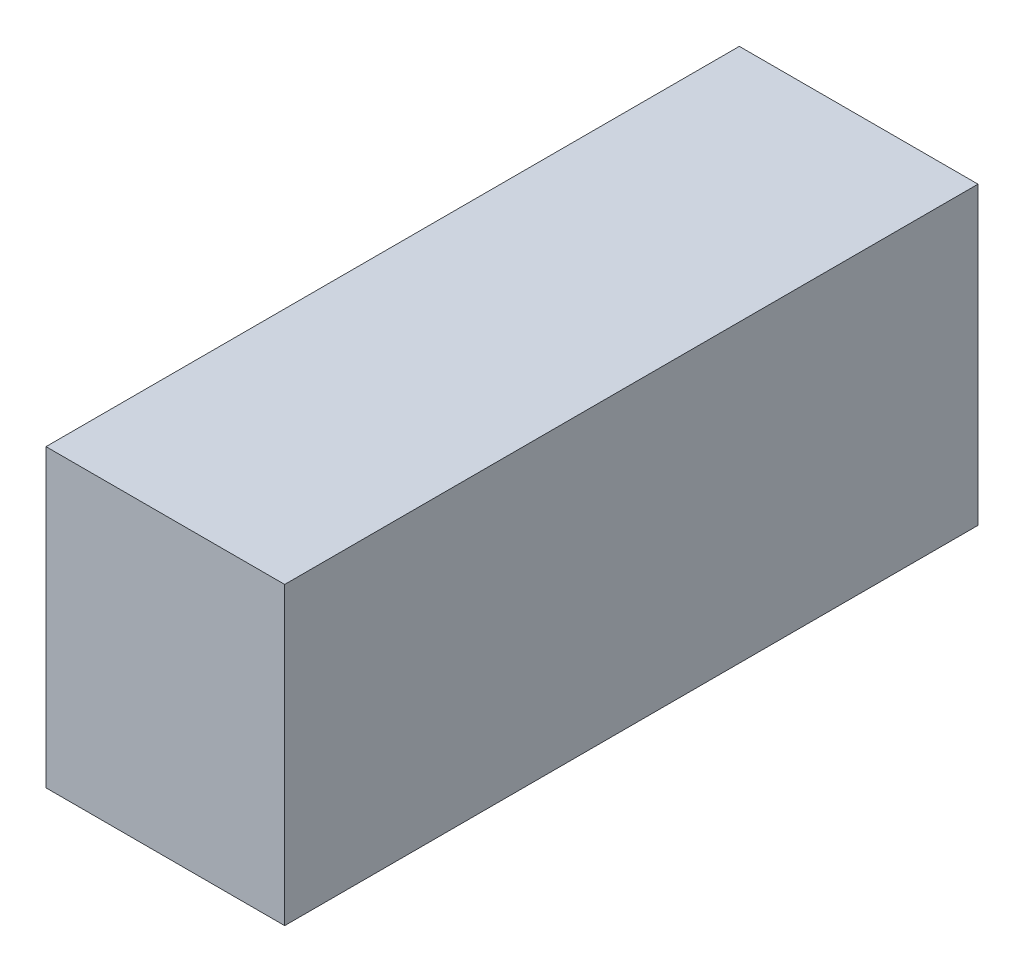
ISO-10303-21;
HEADER;
FILE_DESCRIPTION(('STEP AP214'),'2;1');
FILE_NAME('part.step','',(''),(''),'','','');
FILE_SCHEMA(('AUTOMOTIVE_DESIGN { 1 0 10303 214 1 1 1 1 }'));
ENDSEC;
DATA;
#1=APPLICATION_CONTEXT('core data for automotive mechanical design processes');
#2=APPLICATION_PROTOCOL_DEFINITION('international standard','automotive_design',2000,#1);
#3=PRODUCT_CONTEXT('',#1,'mechanical');
#4=PRODUCT('Part','Part','',(#3));
#5=PRODUCT_RELATED_PRODUCT_CATEGORY('part','',(#4));
#6=PRODUCT_DEFINITION_FORMATION('','',#4);
#7=PRODUCT_DEFINITION_CONTEXT('part definition',#1,'design');
#8=PRODUCT_DEFINITION('design','',#6,#7);
#9=PRODUCT_DEFINITION_SHAPE('','',#8);
#10=(LENGTH_UNIT() NAMED_UNIT(*) SI_UNIT(.MILLI.,.METRE.));
#11=(NAMED_UNIT(*) PLANE_ANGLE_UNIT() SI_UNIT($,.RADIAN.));
#12=(NAMED_UNIT(*) SI_UNIT($,.STERADIAN.) SOLID_ANGLE_UNIT());
#13=UNCERTAINTY_MEASURE_WITH_UNIT(LENGTH_MEASURE(1.E-05),#10,'distance_accuracy_value','');
#14=(GEOMETRIC_REPRESENTATION_CONTEXT(3) GLOBAL_UNCERTAINTY_ASSIGNED_CONTEXT((#13)) GLOBAL_UNIT_ASSIGNED_CONTEXT((#10,
#11,#12)) REPRESENTATION_CONTEXT('',''));
#15=CARTESIAN_POINT('',(0.,0.,0.));
#16=DIRECTION('',(0.,0.,1.));
#17=DIRECTION('',(1.,0.,0.));
#18=AXIS2_PLACEMENT_3D('',#15,#16,#17);
#19=CARTESIAN_POINT('',(22.9249767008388,62.1486486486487,300.));
#20=DIRECTION('',(0.,-1.,0.));
#21=DIRECTION('',(1.,0.,0.));
#22=AXIS2_PLACEMENT_3D('',#19,#20,#21);
#23=PLANE('',#22);
#24=DIRECTION('',(-1.,0.,0.));
#25=VECTOR('',#24,1.);
#26=CARTESIAN_POINT('',(22.9249767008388,62.1486486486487,0.));
#27=LINE('',#26,#25);
#28=CARTESIAN_POINT('',(22.9249767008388,62.1486486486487,0.));
#29=VERTEX_POINT('',#28);
#30=CARTESIAN_POINT('',(-82.0750232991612,62.1486486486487,0.));
#31=VERTEX_POINT('',#30);
#32=EDGE_CURVE('E133',#29,#31,#27,.T.);
#33=ORIENTED_EDGE('',*,*,#32,.T.);
#34=DIRECTION('',(0.,0.,-1.));
#35=VECTOR('',#34,1.);
#36=CARTESIAN_POINT('',(-82.0750232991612,62.1486486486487,300.));
#37=LINE('',#36,#35);
#38=CARTESIAN_POINT('',(-82.0750232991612,62.1486486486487,305.));
#39=VERTEX_POINT('',#38);
#40=EDGE_CURVE('E11',#39,#31,#37,.T.);
#41=ORIENTED_EDGE('',*,*,#40,.F.);
#42=DIRECTION('',(-1.,0.,0.));
#43=VECTOR('',#42,1.);
#44=CARTESIAN_POINT('',(-82.0750232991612,62.1486486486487,305.));
#45=LINE('',#44,#43);
#46=CARTESIAN_POINT('',(22.9249767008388,62.1486486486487,305.));
#47=VERTEX_POINT('',#46);
#48=EDGE_CURVE('E127',#47,#39,#45,.T.);
#49=ORIENTED_EDGE('',*,*,#48,.F.);
#50=DIRECTION('',(0.,0.,-1.));
#51=VECTOR('',#50,1.);
#52=CARTESIAN_POINT('',(22.9249767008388,62.1486486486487,300.));
#53=LINE('',#52,#51);
#54=EDGE_CURVE('E144',#47,#29,#53,.T.);
#55=ORIENTED_EDGE('',*,*,#54,.T.);
#56=EDGE_LOOP('',(#33,#41,#49,#55));
#57=FACE_BOUND('',#56,.T.);
#58=ADVANCED_FACE('F33',(#57),#23,.F.);
#59=CARTESIAN_POINT('',(-82.0750232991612,57.1486486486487,300.));
#60=DIRECTION('',(0.,1.,0.));
#61=DIRECTION('',(0.,0.,1.));
#62=AXIS2_PLACEMENT_3D('',#59,#60,#61);
#63=PLANE('',#62);
#64=DIRECTION('',(1.,0.,0.));
#65=VECTOR('',#64,1.);
#66=CARTESIAN_POINT('',(-82.0750232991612,57.1486486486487,0.));
#67=LINE('',#66,#65);
#68=CARTESIAN_POINT('',(-82.0750232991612,57.1486486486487,0.));
#69=VERTEX_POINT('',#68);
#70=CARTESIAN_POINT('',(17.9249767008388,57.1486486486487,0.));
#71=VERTEX_POINT('',#70);
#72=EDGE_CURVE('E149',#69,#71,#67,.T.);
#73=ORIENTED_EDGE('',*,*,#72,.T.);
#74=DIRECTION('',(0.,0.,-1.));
#75=VECTOR('',#74,1.);
#76=CARTESIAN_POINT('',(17.9249767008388,57.1486486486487,300.));
#77=LINE('',#76,#75);
#78=CARTESIAN_POINT('',(17.9249767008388,57.1486486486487,300.));
#79=VERTEX_POINT('',#78);
#80=EDGE_CURVE('E162',#79,#71,#77,.T.);
#81=ORIENTED_EDGE('',*,*,#80,.F.);
#82=DIRECTION('',(1.,0.,0.));
#83=VECTOR('',#82,1.);
#84=CARTESIAN_POINT('',(-82.0750232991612,57.1486486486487,300.));
#85=LINE('',#84,#83);
#86=CARTESIAN_POINT('',(-82.0750232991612,57.1486486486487,300.));
#87=VERTEX_POINT('',#86);
#88=EDGE_CURVE('E135',#87,#79,#85,.T.);
#89=ORIENTED_EDGE('',*,*,#88,.F.);
#90=DIRECTION('',(0.,0.,-1.));
#91=VECTOR('',#90,1.);
#92=CARTESIAN_POINT('',(-82.0750232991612,57.1486486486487,300.));
#93=LINE('',#92,#91);
#94=EDGE_CURVE('E41',#87,#69,#93,.T.);
#95=ORIENTED_EDGE('',*,*,#94,.T.);
#96=EDGE_LOOP('',(#73,#81,#89,#95));
#97=FACE_BOUND('',#96,.T.);
#98=ADVANCED_FACE('F166',(#97),#63,.F.);
#99=CARTESIAN_POINT('',(17.9249767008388,57.1486486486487,300.));
#100=DIRECTION('',(1.,0.,0.));
#101=DIRECTION('',(0.,1.,0.));
#102=AXIS2_PLACEMENT_3D('',#99,#100,#101);
#103=PLANE('',#102);
#104=DIRECTION('',(0.,-1.,0.));
#105=VECTOR('',#104,1.);
#106=CARTESIAN_POINT('',(17.9249767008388,57.1486486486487,0.));
#107=LINE('',#106,#105);
#108=CARTESIAN_POINT('',(17.9249767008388,-62.8513513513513,0.));
#109=VERTEX_POINT('',#108);
#110=EDGE_CURVE('E151',#71,#109,#107,.T.);
#111=ORIENTED_EDGE('',*,*,#110,.T.);
#112=DIRECTION('',(0.,0.,-1.));
#113=VECTOR('',#112,1.);
#114=CARTESIAN_POINT('',(17.9249767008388,-62.8513513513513,300.));
#115=LINE('',#114,#113);
#116=CARTESIAN_POINT('',(17.9249767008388,-62.8513513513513,300.));
#117=VERTEX_POINT('',#116);
#118=EDGE_CURVE('E49',#117,#109,#115,.T.);
#119=ORIENTED_EDGE('',*,*,#118,.F.);
#120=DIRECTION('',(0.,-1.,0.));
#121=VECTOR('',#120,1.);
#122=CARTESIAN_POINT('',(17.9249767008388,57.1486486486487,300.));
#123=LINE('',#122,#121);
#124=EDGE_CURVE('E138',#79,#117,#123,.T.);
#125=ORIENTED_EDGE('',*,*,#124,.F.);
#126=ORIENTED_EDGE('',*,*,#80,.T.);
#127=EDGE_LOOP('',(#111,#119,#125,#126));
#128=FACE_BOUND('',#127,.T.);
#129=ADVANCED_FACE('F173',(#128),#103,.F.);
#130=CARTESIAN_POINT('',(17.9249767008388,-62.8513513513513,300.));
#131=DIRECTION('',(0.,-1.,0.));
#132=DIRECTION('',(0.,0.,-1.));
#133=AXIS2_PLACEMENT_3D('',#130,#131,#132);
#134=PLANE('',#133);
#135=DIRECTION('',(-1.,0.,0.));
#136=VECTOR('',#135,1.);
#137=CARTESIAN_POINT('',(17.9249767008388,-62.8513513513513,0.));
#138=LINE('',#137,#136);
#139=CARTESIAN_POINT('',(-82.0750232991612,-62.8513513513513,0.));
#140=VERTEX_POINT('',#139);
#141=EDGE_CURVE('E153',#109,#140,#138,.T.);
#142=ORIENTED_EDGE('',*,*,#141,.T.);
#143=DIRECTION('',(0.,0.,-1.));
#144=VECTOR('',#143,1.);
#145=CARTESIAN_POINT('',(-82.0750232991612,-62.8513513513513,300.));
#146=LINE('',#145,#144);
#147=CARTESIAN_POINT('',(-82.0750232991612,-62.8513513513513,300.));
#148=VERTEX_POINT('',#147);
#149=EDGE_CURVE('E113',#148,#140,#146,.T.);
#150=ORIENTED_EDGE('',*,*,#149,.F.);
#151=DIRECTION('',(-1.,0.,0.));
#152=VECTOR('',#151,1.);
#153=CARTESIAN_POINT('',(17.9249767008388,-62.8513513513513,300.));
#154=LINE('',#153,#152);
#155=EDGE_CURVE('E141',#117,#148,#154,.T.);
#156=ORIENTED_EDGE('',*,*,#155,.F.);
#157=ORIENTED_EDGE('',*,*,#118,.T.);
#158=EDGE_LOOP('',(#142,#150,#156,#157));
#159=FACE_BOUND('',#158,.T.);
#160=ADVANCED_FACE('F175',(#159),#134,.F.);
#161=CARTESIAN_POINT('',(-82.0750232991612,-62.8513513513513,300.));
#162=DIRECTION('',(1.,0.,0.));
#163=DIRECTION('',(0.,1.,0.));
#164=AXIS2_PLACEMENT_3D('',#161,#162,#163);
#165=PLANE('',#164);
#166=DIRECTION('',(0.,-1.,0.));
#167=VECTOR('',#166,1.);
#168=CARTESIAN_POINT('',(-82.0750232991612,-62.8513513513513,0.));
#169=LINE('',#168,#167);
#170=CARTESIAN_POINT('',(-82.0750232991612,-67.8513513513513,0.));
#171=VERTEX_POINT('',#170);
#172=EDGE_CURVE('E112',#140,#171,#169,.T.);
#173=ORIENTED_EDGE('',*,*,#172,.T.);
#174=DIRECTION('',(0.,0.,-1.));
#175=VECTOR('',#174,1.);
#176=CARTESIAN_POINT('',(-82.0750232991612,-67.8513513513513,300.));
#177=LINE('',#176,#175);
#178=CARTESIAN_POINT('',(-82.0750232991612,-67.8513513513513,305.));
#179=VERTEX_POINT('',#178);
#180=EDGE_CURVE('E105',#179,#171,#177,.T.);
#181=ORIENTED_EDGE('',*,*,#180,.F.);
#182=DIRECTION('',(0.,-1.,0.));
#183=VECTOR('',#182,1.);
#184=CARTESIAN_POINT('',(-82.0750232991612,62.1486486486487,305.));
#185=LINE('',#184,#183);
#186=EDGE_CURVE('E109',#39,#179,#185,.T.);
#187=ORIENTED_EDGE('',*,*,#186,.F.);
#188=ORIENTED_EDGE('',*,*,#40,.T.);
#189=DIRECTION('',(0.,-1.,0.));
#190=VECTOR('',#189,1.);
#191=CARTESIAN_POINT('',(-82.0750232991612,62.1486486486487,0.));
#192=LINE('',#191,#190);
#193=EDGE_CURVE('E147',#31,#69,#192,.T.);
#194=ORIENTED_EDGE('',*,*,#193,.T.);
#195=ORIENTED_EDGE('',*,*,#94,.F.);
#196=DIRECTION('',(0.,-1.,0.));
#197=VECTOR('',#196,1.);
#198=CARTESIAN_POINT('',(-82.0750232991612,62.1486486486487,300.));
#199=LINE('',#198,#197);
#200=EDGE_CURVE('E128',#87,#148,#199,.T.);
#201=ORIENTED_EDGE('',*,*,#200,.T.);
#202=ORIENTED_EDGE('',*,*,#149,.T.);
#203=EDGE_LOOP('',(#173,#181,#187,#188,#194,#195,#201,#202));
#204=FACE_BOUND('',#203,.T.);
#205=ADVANCED_FACE('F107',(#204),#165,.F.);
#206=CARTESIAN_POINT('',(-82.0750232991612,-67.8513513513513,300.));
#207=DIRECTION('',(0.,1.,0.));
#208=DIRECTION('',(0.,0.,1.));
#209=AXIS2_PLACEMENT_3D('',#206,#207,#208);
#210=PLANE('',#209);
#211=DIRECTION('',(1.,0.,0.));
#212=VECTOR('',#211,1.);
#213=CARTESIAN_POINT('',(-82.0750232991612,-67.8513513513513,0.));
#214=LINE('',#213,#212);
#215=CARTESIAN_POINT('',(22.9249767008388,-67.8513513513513,0.));
#216=VERTEX_POINT('',#215);
#217=EDGE_CURVE('E79',#171,#216,#214,.T.);
#218=ORIENTED_EDGE('',*,*,#217,.T.);
#219=DIRECTION('',(0.,0.,-1.));
#220=VECTOR('',#219,1.);
#221=CARTESIAN_POINT('',(22.9249767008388,-67.8513513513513,300.));
#222=LINE('',#221,#220);
#223=CARTESIAN_POINT('',(22.9249767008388,-67.8513513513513,305.));
#224=VERTEX_POINT('',#223);
#225=EDGE_CURVE('E114',#224,#216,#222,.T.);
#226=ORIENTED_EDGE('',*,*,#225,.F.);
#227=DIRECTION('',(1.,0.,0.));
#228=VECTOR('',#227,1.);
#229=CARTESIAN_POINT('',(-82.0750232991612,-67.8513513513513,305.));
#230=LINE('',#229,#228);
#231=EDGE_CURVE('E117',#179,#224,#230,.T.);
#232=ORIENTED_EDGE('',*,*,#231,.F.);
#233=ORIENTED_EDGE('',*,*,#180,.T.);
#234=EDGE_LOOP('',(#218,#226,#232,#233));
#235=FACE_BOUND('',#234,.T.);
#236=ADVANCED_FACE('F118',(#235),#210,.F.);
#237=CARTESIAN_POINT('',(22.9249767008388,-67.8513513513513,300.));
#238=DIRECTION('',(-1.,0.,0.));
#239=DIRECTION('',(0.,0.,1.));
#240=AXIS2_PLACEMENT_3D('',#237,#238,#239);
#241=PLANE('',#240);
#242=DIRECTION('',(0.,1.,0.));
#243=VECTOR('',#242,1.);
#244=CARTESIAN_POINT('',(22.9249767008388,-67.8513513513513,0.));
#245=LINE('',#244,#243);
#246=EDGE_CURVE('E85',#216,#29,#245,.T.);
#247=ORIENTED_EDGE('',*,*,#246,.T.);
#248=ORIENTED_EDGE('',*,*,#54,.F.);
#249=DIRECTION('',(0.,1.,0.));
#250=VECTOR('',#249,1.);
#251=CARTESIAN_POINT('',(22.9249767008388,62.1486486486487,305.));
#252=LINE('',#251,#250);
#253=EDGE_CURVE('E122',#224,#47,#252,.T.);
#254=ORIENTED_EDGE('',*,*,#253,.F.);
#255=ORIENTED_EDGE('',*,*,#225,.T.);
#256=EDGE_LOOP('',(#247,#248,#254,#255));
#257=FACE_BOUND('',#256,.T.);
#258=ADVANCED_FACE('F179',(#257),#241,.F.);
#259=CARTESIAN_POINT('',(0.,0.,0.));
#260=DIRECTION('',(0.,0.,1.));
#261=DIRECTION('',(1.,0.,0.));
#262=AXIS2_PLACEMENT_3D('',#259,#260,#261);
#263=PLANE('',#262);
#264=ORIENTED_EDGE('',*,*,#32,.F.);
#265=ORIENTED_EDGE('',*,*,#246,.F.);
#266=ORIENTED_EDGE('',*,*,#217,.F.);
#267=ORIENTED_EDGE('',*,*,#172,.F.);
#268=ORIENTED_EDGE('',*,*,#141,.F.);
#269=ORIENTED_EDGE('',*,*,#110,.F.);
#270=ORIENTED_EDGE('',*,*,#72,.F.);
#271=ORIENTED_EDGE('',*,*,#193,.F.);
#272=EDGE_LOOP('',(#264,#265,#266,#267,#268,#269,#270,#271));
#273=FACE_BOUND('',#272,.T.);
#274=ADVANCED_FACE('F171',(#273),#263,.F.);
#275=CARTESIAN_POINT('',(0.,0.,300.));
#276=DIRECTION('',(0.,0.,1.));
#277=DIRECTION('',(1.,0.,0.));
#278=AXIS2_PLACEMENT_3D('',#275,#276,#277);
#279=PLANE('',#278);
#280=ORIENTED_EDGE('',*,*,#200,.F.);
#281=ORIENTED_EDGE('',*,*,#88,.T.);
#282=ORIENTED_EDGE('',*,*,#124,.T.);
#283=ORIENTED_EDGE('',*,*,#155,.T.);
#284=EDGE_LOOP('',(#280,#281,#282,#283));
#285=FACE_BOUND('',#284,.T.);
#286=ADVANCED_FACE('F177',(#285),#279,.F.);
#287=CARTESIAN_POINT('',(0.,0.,305.));
#288=DIRECTION('',(0.,0.,1.));
#289=DIRECTION('',(1.,0.,0.));
#290=AXIS2_PLACEMENT_3D('',#287,#288,#289);
#291=PLANE('',#290);
#292=ORIENTED_EDGE('',*,*,#186,.T.);
#293=ORIENTED_EDGE('',*,*,#231,.T.);
#294=ORIENTED_EDGE('',*,*,#253,.T.);
#295=ORIENTED_EDGE('',*,*,#48,.T.);
#296=EDGE_LOOP('',(#292,#293,#294,#295));
#297=FACE_BOUND('',#296,.T.);
#298=ADVANCED_FACE('F125',(#297),#291,.T.);
#299=CLOSED_SHELL('',(#58,#98,#129,#160,#205,#236,#258,#274,#286,#298));
#300=MANIFOLD_SOLID_BREP('B2',#299);
#301=ADVANCED_BREP_SHAPE_REPRESENTATION('',(#18,#300),#14);
#302=SHAPE_DEFINITION_REPRESENTATION(#9,#301);
ENDSEC;
END-ISO-10303-21;
